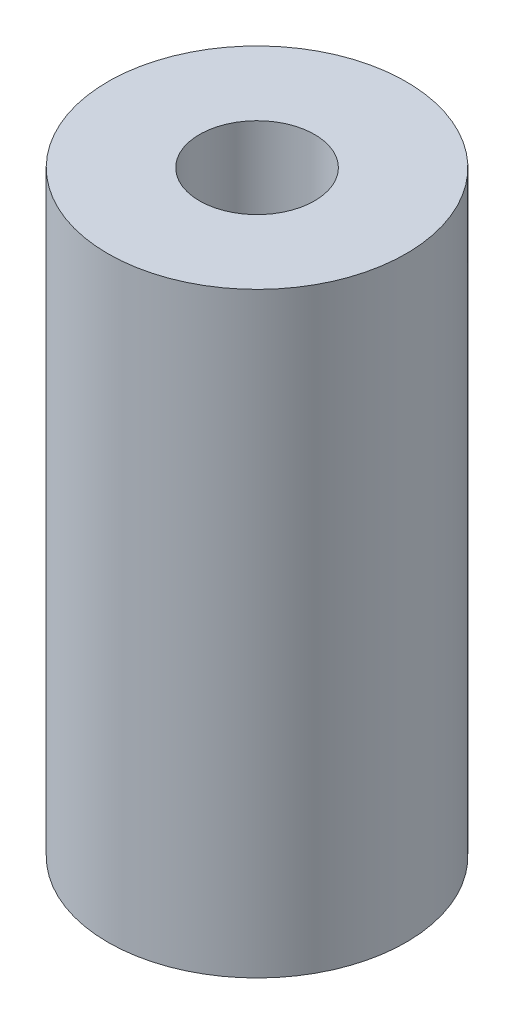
from build123d import *

# Parameters (mm, degrees)
SKETCH1_R               = 12.7
BOSS_EXTRUDE1_DEPTH     = 50.8
F_3_8_CLEARANCE_HOLE1_D = 9.8044


with BuildPart() as part:
    # Sketch1 → Boss-Extrude1 (new body)
    with BuildSketch(Plane(origin=(0, 0, 0), x_dir=(1, 0, 0), z_dir=(0, 1, 0))):
        with Locations(Location((0, 0, 0), (0, 0, 270))):
            Circle(SKETCH1_R)
    extrude(amount=BOSS_EXTRUDE1_DEPTH)

    # 3_8 Clearance Hole1 (through all)
    with Locations(Plane(origin=(0, 50.8, 0), x_dir=(1, 0, 0), z_dir=(0, 1, 0))):
        with Locations((0, 0)):
            Hole(F_3_8_CLEARANCE_HOLE1_D / 2)


solid = part.part
